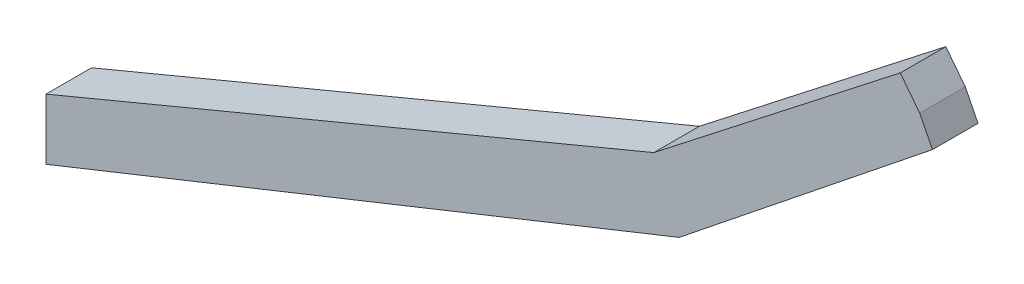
ISO-10303-21;
HEADER;
FILE_DESCRIPTION(('STEP AP214'),'2;1');
FILE_NAME('part.step','',(''),(''),'','','');
FILE_SCHEMA(('AUTOMOTIVE_DESIGN { 1 0 10303 214 1 1 1 1 }'));
ENDSEC;
DATA;
#1=APPLICATION_CONTEXT('core data for automotive mechanical design processes');
#2=APPLICATION_PROTOCOL_DEFINITION('international standard','automotive_design',2000,#1);
#3=PRODUCT_CONTEXT('',#1,'mechanical');
#4=PRODUCT('Part','Part','',(#3));
#5=PRODUCT_RELATED_PRODUCT_CATEGORY('part','',(#4));
#6=PRODUCT_DEFINITION_FORMATION('','',#4);
#7=PRODUCT_DEFINITION_CONTEXT('part definition',#1,'design');
#8=PRODUCT_DEFINITION('design','',#6,#7);
#9=PRODUCT_DEFINITION_SHAPE('','',#8);
#10=(LENGTH_UNIT() NAMED_UNIT(*) SI_UNIT(.MILLI.,.METRE.));
#11=(NAMED_UNIT(*) PLANE_ANGLE_UNIT() SI_UNIT($,.RADIAN.));
#12=(NAMED_UNIT(*) SI_UNIT($,.STERADIAN.) SOLID_ANGLE_UNIT());
#13=UNCERTAINTY_MEASURE_WITH_UNIT(LENGTH_MEASURE(1.E-05),#10,'distance_accuracy_value','');
#14=(GEOMETRIC_REPRESENTATION_CONTEXT(3) GLOBAL_UNCERTAINTY_ASSIGNED_CONTEXT((#13)) GLOBAL_UNIT_ASSIGNED_CONTEXT((#10,
#11,#12)) REPRESENTATION_CONTEXT('',''));
#15=CARTESIAN_POINT('',(0.,0.,0.));
#16=DIRECTION('',(0.,0.,1.));
#17=DIRECTION('',(1.,0.,0.));
#18=AXIS2_PLACEMENT_3D('',#15,#16,#17);
#19=CARTESIAN_POINT('',(0.,1200.,1800.));
#20=DIRECTION('',(1.,0.,0.));
#21=DIRECTION('',(0.,0.,-1.));
#22=AXIS2_PLACEMENT_3D('',#19,#20,#21);
#23=PLANE('',#22);
#24=DIRECTION('',(0.,-1.,0.));
#25=VECTOR('',#24,1.);
#26=CARTESIAN_POINT('',(0.,1200.,0.));
#27=LINE('',#26,#25);
#28=CARTESIAN_POINT('',(0.,2400.,0.));
#29=VERTEX_POINT('',#28);
#30=CARTESIAN_POINT('',(0.,0.,0.));
#31=VERTEX_POINT('',#30);
#32=EDGE_CURVE('E131',#29,#31,#27,.T.);
#33=ORIENTED_EDGE('',*,*,#32,.T.);
#34=DIRECTION('',(0.,0.,-1.));
#35=VECTOR('',#34,1.);
#36=CARTESIAN_POINT('',(0.,0.,1800.));
#37=LINE('',#36,#35);
#38=CARTESIAN_POINT('',(0.,0.,1800.));
#39=VERTEX_POINT('',#38);
#40=EDGE_CURVE('E11',#39,#31,#37,.T.);
#41=ORIENTED_EDGE('',*,*,#40,.F.);
#42=DIRECTION('',(0.,-1.,0.));
#43=VECTOR('',#42,1.);
#44=CARTESIAN_POINT('',(0.,1200.,1800.));
#45=LINE('',#44,#43);
#46=CARTESIAN_POINT('',(0.,2400.,1800.));
#47=VERTEX_POINT('',#46);
#48=EDGE_CURVE('E134',#47,#39,#45,.T.);
#49=ORIENTED_EDGE('',*,*,#48,.F.);
#50=DIRECTION('',(0.,0.,-1.));
#51=VECTOR('',#50,1.);
#52=CARTESIAN_POINT('',(0.,2400.,1800.));
#53=LINE('',#52,#51);
#54=EDGE_CURVE('E145',#47,#29,#53,.T.);
#55=ORIENTED_EDGE('',*,*,#54,.T.);
#56=EDGE_LOOP('',(#33,#41,#49,#55));
#57=FACE_BOUND('',#56,.T.);
#58=ADVANCED_FACE('F39',(#57),#23,.F.);
#59=CARTESIAN_POINT('',(0.,0.,1800.));
#60=DIRECTION('',(-0.371390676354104,0.928476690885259,0.));
#61=DIRECTION('',(-0.92847669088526,-0.371390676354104,0.));
#62=AXIS2_PLACEMENT_3D('',#59,#60,#61);
#63=PLANE('',#62);
#64=DIRECTION('',(0.928476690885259,0.371390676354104,0.));
#65=VECTOR('',#64,1.);
#66=CARTESIAN_POINT('',(0.,0.,0.));
#67=LINE('',#66,#65);
#68=CARTESIAN_POINT('',(25000.,10000.,0.));
#69=VERTEX_POINT('',#68);
#70=EDGE_CURVE('E66',#31,#69,#67,.T.);
#71=ORIENTED_EDGE('',*,*,#70,.T.);
#72=DIRECTION('',(0.,0.,-1.));
#73=VECTOR('',#72,1.);
#74=CARTESIAN_POINT('',(25000.,10000.,1800.));
#75=LINE('',#74,#73);
#76=CARTESIAN_POINT('',(25000.,10000.,1800.));
#77=VERTEX_POINT('',#76);
#78=EDGE_CURVE('E50',#77,#69,#75,.T.);
#79=ORIENTED_EDGE('',*,*,#78,.F.);
#80=DIRECTION('',(0.928476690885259,0.371390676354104,0.));
#81=VECTOR('',#80,1.);
#82=CARTESIAN_POINT('',(0.,0.,1800.));
#83=LINE('',#82,#81);
#84=EDGE_CURVE('E79',#39,#77,#83,.T.);
#85=ORIENTED_EDGE('',*,*,#84,.F.);
#86=ORIENTED_EDGE('',*,*,#40,.T.);
#87=EDGE_LOOP('',(#71,#79,#85,#86));
#88=FACE_BOUND('',#87,.T.);
#89=ADVANCED_FACE('F170',(#88),#63,.F.);
#90=CARTESIAN_POINT('',(25000.,10000.,1800.));
#91=DIRECTION('',(-0.624695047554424,0.78086880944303,0.));
#92=DIRECTION('',(-0.78086880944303,-0.624695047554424,0.));
#93=AXIS2_PLACEMENT_3D('',#90,#91,#92);
#94=PLANE('',#93);
#95=DIRECTION('',(0.78086880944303,0.624695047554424,0.));
#96=VECTOR('',#95,1.);
#97=CARTESIAN_POINT('',(25000.,10000.,0.));
#98=LINE('',#97,#96);
#99=CARTESIAN_POINT('',(35000.,18000.,0.));
#100=VERTEX_POINT('',#99);
#101=EDGE_CURVE('E71',#69,#100,#98,.T.);
#102=ORIENTED_EDGE('',*,*,#101,.T.);
#103=DIRECTION('',(0.,0.,-1.));
#104=VECTOR('',#103,1.);
#105=CARTESIAN_POINT('',(35000.,18000.,1800.));
#106=LINE('',#105,#104);
#107=CARTESIAN_POINT('',(35000.,18000.,1800.));
#108=VERTEX_POINT('',#107);
#109=EDGE_CURVE('E121',#108,#100,#106,.T.);
#110=ORIENTED_EDGE('',*,*,#109,.F.);
#111=DIRECTION('',(0.78086880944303,0.624695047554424,0.));
#112=VECTOR('',#111,1.);
#113=CARTESIAN_POINT('',(25000.,10000.,1800.));
#114=LINE('',#113,#112);
#115=EDGE_CURVE('E54',#77,#108,#114,.T.);
#116=ORIENTED_EDGE('',*,*,#115,.F.);
#117=ORIENTED_EDGE('',*,*,#78,.T.);
#118=EDGE_LOOP('',(#102,#110,#116,#117));
#119=FACE_BOUND('',#118,.T.);
#120=ADVANCED_FACE('F126',(#119),#94,.F.);
#121=CARTESIAN_POINT('',(35000.,18000.,1800.));
#122=DIRECTION('',(-0.894427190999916,-0.447213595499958,0.));
#123=DIRECTION('',(0.447213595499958,-0.894427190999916,0.));
#124=AXIS2_PLACEMENT_3D('',#121,#122,#123);
#125=PLANE('',#124);
#126=DIRECTION('',(-0.447213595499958,0.894427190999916,0.));
#127=VECTOR('',#126,1.);
#128=CARTESIAN_POINT('',(35000.,18000.,0.));
#129=LINE('',#128,#127);
#130=CARTESIAN_POINT('',(34500.,19000.,0.));
#131=VERTEX_POINT('',#130);
#132=EDGE_CURVE('E125',#100,#131,#129,.T.);
#133=ORIENTED_EDGE('',*,*,#132,.T.);
#134=DIRECTION('',(0.,0.,-1.));
#135=VECTOR('',#134,1.);
#136=CARTESIAN_POINT('',(34500.,19000.,1800.));
#137=LINE('',#136,#135);
#138=CARTESIAN_POINT('',(34500.,19000.,1800.));
#139=VERTEX_POINT('',#138);
#140=EDGE_CURVE('E106',#139,#131,#137,.T.);
#141=ORIENTED_EDGE('',*,*,#140,.F.);
#142=DIRECTION('',(-0.447213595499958,0.894427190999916,0.));
#143=VECTOR('',#142,1.);
#144=CARTESIAN_POINT('',(35000.,18000.,1800.));
#145=LINE('',#144,#143);
#146=EDGE_CURVE('E113',#108,#139,#145,.T.);
#147=ORIENTED_EDGE('',*,*,#146,.F.);
#148=ORIENTED_EDGE('',*,*,#109,.T.);
#149=EDGE_LOOP('',(#133,#141,#147,#148));
#150=FACE_BOUND('',#149,.T.);
#151=ADVANCED_FACE('F117',(#150),#125,.F.);
#152=CARTESIAN_POINT('',(0.,0.,1800.));
#153=DIRECTION('',(0.,0.,1.));
#154=DIRECTION('',(1.,0.,0.));
#155=AXIS2_PLACEMENT_3D('',#152,#153,#154);
#156=PLANE('',#155);
#157=ORIENTED_EDGE('',*,*,#48,.T.);
#158=ORIENTED_EDGE('',*,*,#84,.T.);
#159=ORIENTED_EDGE('',*,*,#115,.T.);
#160=ORIENTED_EDGE('',*,*,#146,.T.);
#161=DIRECTION('',(-0.615031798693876,0.788502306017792,0.));
#162=VECTOR('',#161,1.);
#163=CARTESIAN_POINT('',(34500.,19000.,1800.));
#164=LINE('',#163,#162);
#165=CARTESIAN_POINT('',(33728.9231534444,19988.5600596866,1800.));
#166=VERTEX_POINT('',#165);
#167=EDGE_CURVE('E103',#139,#166,#164,.T.);
#168=ORIENTED_EDGE('',*,*,#167,.T.);
#169=DIRECTION('',(-0.78850230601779,-0.615031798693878,0.));
#170=VECTOR('',#169,1.);
#171=CARTESIAN_POINT('',(33728.9231534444,19988.5600596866,1800.));
#172=LINE('',#171,#170);
#173=CARTESIAN_POINT('',(24000.,12400.,1800.));
#174=VERTEX_POINT('',#173);
#175=EDGE_CURVE('E112',#166,#174,#172,.T.);
#176=ORIENTED_EDGE('',*,*,#175,.T.);
#177=DIRECTION('',(-0.923076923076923,-0.384615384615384,0.));
#178=VECTOR('',#177,1.);
#179=CARTESIAN_POINT('',(24000.,12400.,1800.));
#180=LINE('',#179,#178);
#181=EDGE_CURVE('E150',#174,#47,#180,.T.);
#182=ORIENTED_EDGE('',*,*,#181,.T.);
#183=EDGE_LOOP('',(#157,#158,#159,#160,#168,#176,#182));
#184=FACE_BOUND('',#183,.T.);
#185=ADVANCED_FACE('F119',(#184),#156,.T.);
#186=CARTESIAN_POINT('',(0.,0.,0.));
#187=DIRECTION('',(0.,0.,1.));
#188=DIRECTION('',(1.,0.,0.));
#189=AXIS2_PLACEMENT_3D('',#186,#187,#188);
#190=PLANE('',#189);
#191=ORIENTED_EDGE('',*,*,#32,.F.);
#192=DIRECTION('',(-0.923076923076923,-0.384615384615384,0.));
#193=VECTOR('',#192,1.);
#194=CARTESIAN_POINT('',(24000.,12400.,0.));
#195=LINE('',#194,#193);
#196=CARTESIAN_POINT('',(24000.,12400.,0.));
#197=VERTEX_POINT('',#196);
#198=EDGE_CURVE('E115',#197,#29,#195,.T.);
#199=ORIENTED_EDGE('',*,*,#198,.F.);
#200=DIRECTION('',(-0.78850230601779,-0.615031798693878,0.));
#201=VECTOR('',#200,1.);
#202=CARTESIAN_POINT('',(33728.9231534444,19988.5600596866,0.));
#203=LINE('',#202,#201);
#204=CARTESIAN_POINT('',(33728.9231534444,19988.5600596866,0.));
#205=VERTEX_POINT('',#204);
#206=EDGE_CURVE('E147',#205,#197,#203,.T.);
#207=ORIENTED_EDGE('',*,*,#206,.F.);
#208=DIRECTION('',(-0.615031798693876,0.788502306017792,0.));
#209=VECTOR('',#208,1.);
#210=CARTESIAN_POINT('',(34500.,19000.,0.));
#211=LINE('',#210,#209);
#212=EDGE_CURVE('E155',#131,#205,#211,.T.);
#213=ORIENTED_EDGE('',*,*,#212,.F.);
#214=ORIENTED_EDGE('',*,*,#132,.F.);
#215=ORIENTED_EDGE('',*,*,#101,.F.);
#216=ORIENTED_EDGE('',*,*,#70,.F.);
#217=EDGE_LOOP('',(#191,#199,#207,#213,#214,#215,#216));
#218=FACE_BOUND('',#217,.T.);
#219=ADVANCED_FACE('F128',(#218),#190,.F.);
#220=CARTESIAN_POINT('',(34500.,19000.,1800.));
#221=DIRECTION('',(-0.788502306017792,-0.615031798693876,0.));
#222=DIRECTION('',(0.615031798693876,-0.788502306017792,0.));
#223=AXIS2_PLACEMENT_3D('',#220,#221,#222);
#224=PLANE('',#223);
#225=ORIENTED_EDGE('',*,*,#212,.T.);
#226=DIRECTION('',(0.,0.,-1.));
#227=VECTOR('',#226,1.);
#228=CARTESIAN_POINT('',(33728.9231534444,19988.5600596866,1800.));
#229=LINE('',#228,#227);
#230=EDGE_CURVE('E108',#166,#205,#229,.T.);
#231=ORIENTED_EDGE('',*,*,#230,.F.);
#232=ORIENTED_EDGE('',*,*,#167,.F.);
#233=ORIENTED_EDGE('',*,*,#140,.T.);
#234=EDGE_LOOP('',(#225,#231,#232,#233));
#235=FACE_BOUND('',#234,.T.);
#236=ADVANCED_FACE('F102',(#235),#224,.F.);
#237=CARTESIAN_POINT('',(33728.9231534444,19988.5600596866,1800.));
#238=DIRECTION('',(0.615031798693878,-0.788502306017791,0.));
#239=DIRECTION('',(0.788502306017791,0.615031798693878,0.));
#240=AXIS2_PLACEMENT_3D('',#237,#238,#239);
#241=PLANE('',#240);
#242=ORIENTED_EDGE('',*,*,#206,.T.);
#243=DIRECTION('',(0.,0.,-1.));
#244=VECTOR('',#243,1.);
#245=CARTESIAN_POINT('',(24000.,12400.,1800.));
#246=LINE('',#245,#244);
#247=EDGE_CURVE('E143',#174,#197,#246,.T.);
#248=ORIENTED_EDGE('',*,*,#247,.F.);
#249=ORIENTED_EDGE('',*,*,#175,.F.);
#250=ORIENTED_EDGE('',*,*,#230,.T.);
#251=EDGE_LOOP('',(#242,#248,#249,#250));
#252=FACE_BOUND('',#251,.T.);
#253=ADVANCED_FACE('F159',(#252),#241,.F.);
#254=CARTESIAN_POINT('',(24000.,12400.,1800.));
#255=DIRECTION('',(0.384615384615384,-0.923076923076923,0.));
#256=DIRECTION('',(0.923076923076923,0.384615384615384,0.));
#257=AXIS2_PLACEMENT_3D('',#254,#255,#256);
#258=PLANE('',#257);
#259=ORIENTED_EDGE('',*,*,#198,.T.);
#260=ORIENTED_EDGE('',*,*,#54,.F.);
#261=ORIENTED_EDGE('',*,*,#181,.F.);
#262=ORIENTED_EDGE('',*,*,#247,.T.);
#263=EDGE_LOOP('',(#259,#260,#261,#262));
#264=FACE_BOUND('',#263,.T.);
#265=ADVANCED_FACE('F163',(#264),#258,.F.);
#266=CLOSED_SHELL('',(#58,#89,#120,#151,#185,#219,#236,#253,#265));
#267=MANIFOLD_SOLID_BREP('B2',#266);
#268=ADVANCED_BREP_SHAPE_REPRESENTATION('',(#18,#267),#14);
#269=SHAPE_DEFINITION_REPRESENTATION(#9,#268);
ENDSEC;
END-ISO-10303-21;
